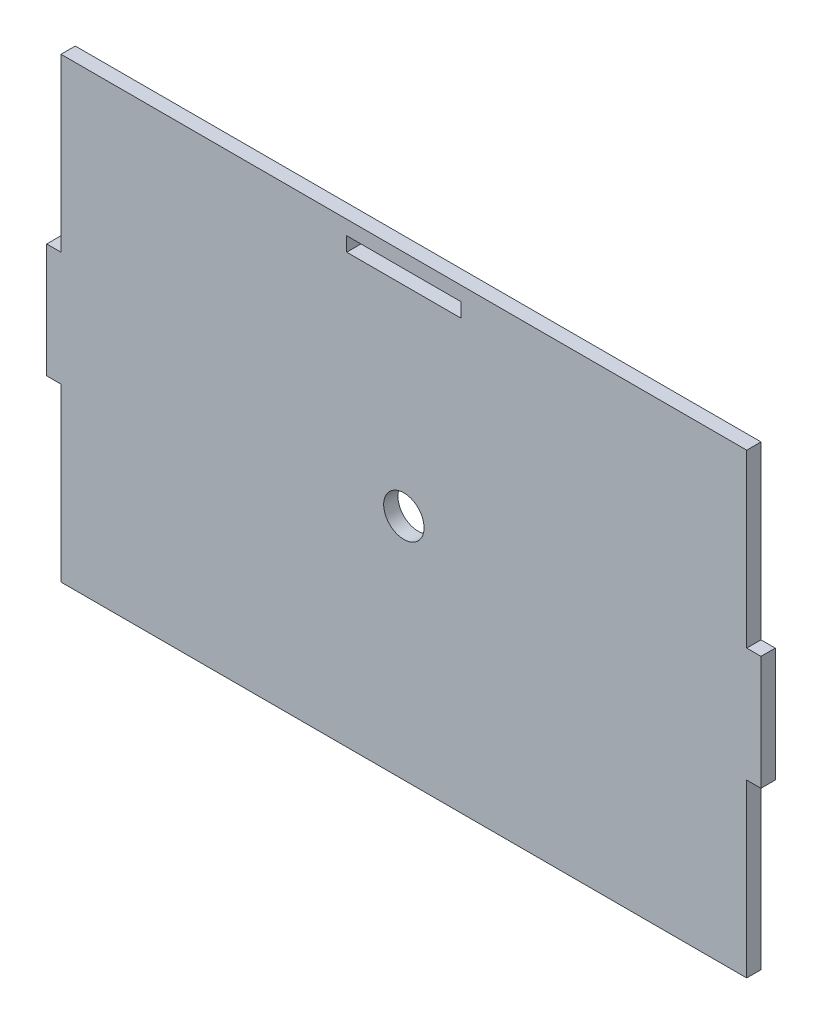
ISO-10303-21;
HEADER;
FILE_DESCRIPTION(('STEP AP214'),'2;1');
FILE_NAME('part.step','',(''),(''),'','','');
FILE_SCHEMA(('AUTOMOTIVE_DESIGN { 1 0 10303 214 1 1 1 1 }'));
ENDSEC;
DATA;
#1=APPLICATION_CONTEXT('core data for automotive mechanical design processes');
#2=APPLICATION_PROTOCOL_DEFINITION('international standard','automotive_design',2000,#1);
#3=PRODUCT_CONTEXT('',#1,'mechanical');
#4=PRODUCT('Part','Part','',(#3));
#5=PRODUCT_RELATED_PRODUCT_CATEGORY('part','',(#4));
#6=PRODUCT_DEFINITION_FORMATION('','',#4);
#7=PRODUCT_DEFINITION_CONTEXT('part definition',#1,'design');
#8=PRODUCT_DEFINITION('design','',#6,#7);
#9=PRODUCT_DEFINITION_SHAPE('','',#8);
#10=(LENGTH_UNIT() NAMED_UNIT(*) SI_UNIT(.MILLI.,.METRE.));
#11=(NAMED_UNIT(*) PLANE_ANGLE_UNIT() SI_UNIT($,.RADIAN.));
#12=(NAMED_UNIT(*) SI_UNIT($,.STERADIAN.) SOLID_ANGLE_UNIT());
#13=UNCERTAINTY_MEASURE_WITH_UNIT(LENGTH_MEASURE(1.E-05),#10,'distance_accuracy_value','');
#14=(GEOMETRIC_REPRESENTATION_CONTEXT(3) GLOBAL_UNCERTAINTY_ASSIGNED_CONTEXT((#13)) GLOBAL_UNIT_ASSIGNED_CONTEXT((#10,
#11,#12)) REPRESENTATION_CONTEXT('',''));
#15=CARTESIAN_POINT('',(0.,0.,0.));
#16=DIRECTION('',(0.,0.,1.));
#17=DIRECTION('',(1.,0.,0.));
#18=AXIS2_PLACEMENT_3D('',#15,#16,#17);
#19=CARTESIAN_POINT('',(-65.2029507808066,-1.40232473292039,3.175));
#20=DIRECTION('',(0.,0.,-1.));
#21=DIRECTION('',(-1.,0.,0.));
#22=AXIS2_PLACEMENT_3D('',#19,#20,#21);
#23=PLANE('',#22);
#24=DIRECTION('',(0.,-1.,0.));
#25=VECTOR('',#24,1.);
#26=CARTESIAN_POINT('',(-1.70295078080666,33.5226752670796,3.175));
#27=LINE('',#26,#25);
#28=CARTESIAN_POINT('',(-1.70295078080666,33.5226752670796,3.175));
#29=VERTEX_POINT('',#28);
#30=CARTESIAN_POINT('',(-1.70295078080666,30.3476752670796,3.175));
#31=VERTEX_POINT('',#30);
#32=EDGE_CURVE('E146',#29,#31,#27,.T.);
#33=ORIENTED_EDGE('',*,*,#32,.F.);
#34=DIRECTION('',(-1.,0.,0.));
#35=VECTOR('',#34,1.);
#36=CARTESIAN_POINT('',(-1.70295078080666,33.5226752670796,3.175));
#37=LINE('',#36,#35);
#38=CARTESIAN_POINT('',(23.6970492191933,33.5226752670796,3.175));
#39=VERTEX_POINT('',#38);
#40=EDGE_CURVE('E169',#39,#29,#37,.T.);
#41=ORIENTED_EDGE('',*,*,#40,.F.);
#42=DIRECTION('',(0.,1.,0.));
#43=VECTOR('',#42,1.);
#44=CARTESIAN_POINT('',(23.6970492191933,33.5226752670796,3.175));
#45=LINE('',#44,#43);
#46=CARTESIAN_POINT('',(23.6970492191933,30.3476752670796,3.175));
#47=VERTEX_POINT('',#46);
#48=EDGE_CURVE('E167',#47,#39,#45,.T.);
#49=ORIENTED_EDGE('',*,*,#48,.F.);
#50=DIRECTION('',(1.,0.,0.));
#51=VECTOR('',#50,1.);
#52=CARTESIAN_POINT('',(-1.70295078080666,30.3476752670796,3.175));
#53=LINE('',#52,#51);
#54=EDGE_CURVE('E154',#31,#47,#53,.T.);
#55=ORIENTED_EDGE('',*,*,#54,.F.);
#56=EDGE_LOOP('',(#33,#41,#49,#55));
#57=FACE_BOUND('',#56,.T.);
#58=DIRECTION('',(0.,-1.,0.));
#59=VECTOR('',#58,1.);
#60=CARTESIAN_POINT('',(-65.2029507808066,36.6976752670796,3.175));
#61=LINE('',#60,#59);
#62=CARTESIAN_POINT('',(-65.2029507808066,36.6976752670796,3.175));
#63=VERTEX_POINT('',#62);
#64=CARTESIAN_POINT('',(-65.2029507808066,-1.40232473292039,3.175));
#65=VERTEX_POINT('',#64);
#66=EDGE_CURVE('E185',#63,#65,#61,.T.);
#67=ORIENTED_EDGE('',*,*,#66,.T.);
#68=DIRECTION('',(-1.,0.,0.));
#69=VECTOR('',#68,1.);
#70=CARTESIAN_POINT('',(-65.2029507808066,-1.40232473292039,3.175));
#71=LINE('',#70,#69);
#72=CARTESIAN_POINT('',(-68.3779507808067,-1.40232473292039,3.175));
#73=VERTEX_POINT('',#72);
#74=EDGE_CURVE('E188',#65,#73,#71,.T.);
#75=ORIENTED_EDGE('',*,*,#74,.T.);
#76=DIRECTION('',(0.,-1.,0.));
#77=VECTOR('',#76,1.);
#78=CARTESIAN_POINT('',(-68.3779507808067,-1.40232473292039,3.175));
#79=LINE('',#78,#77);
#80=CARTESIAN_POINT('',(-68.3779507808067,-26.8023247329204,3.175));
#81=VERTEX_POINT('',#80);
#82=EDGE_CURVE('E191',#73,#81,#79,.T.);
#83=ORIENTED_EDGE('',*,*,#82,.T.);
#84=DIRECTION('',(1.,0.,0.));
#85=VECTOR('',#84,1.);
#86=CARTESIAN_POINT('',(-65.2029507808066,-26.8023247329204,3.175));
#87=LINE('',#86,#85);
#88=CARTESIAN_POINT('',(-65.2029507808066,-26.8023247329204,3.175));
#89=VERTEX_POINT('',#88);
#90=EDGE_CURVE('E193',#81,#89,#87,.T.);
#91=ORIENTED_EDGE('',*,*,#90,.T.);
#92=DIRECTION('',(0.,-1.,0.));
#93=VECTOR('',#92,1.);
#94=CARTESIAN_POINT('',(-65.2029507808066,-26.8023247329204,3.175));
#95=LINE('',#94,#93);
#96=CARTESIAN_POINT('',(-65.2029507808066,-64.9023247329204,3.175));
#97=VERTEX_POINT('',#96);
#98=EDGE_CURVE('E195',#89,#97,#95,.T.);
#99=ORIENTED_EDGE('',*,*,#98,.T.);
#100=DIRECTION('',(1.,0.,0.));
#101=VECTOR('',#100,1.);
#102=CARTESIAN_POINT('',(-65.2029507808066,-64.9023247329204,3.175));
#103=LINE('',#102,#101);
#104=CARTESIAN_POINT('',(87.1970492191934,-64.9023247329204,3.175));
#105=VERTEX_POINT('',#104);
#106=EDGE_CURVE('E197',#97,#105,#103,.T.);
#107=ORIENTED_EDGE('',*,*,#106,.T.);
#108=DIRECTION('',(0.,1.,0.));
#109=VECTOR('',#108,1.);
#110=CARTESIAN_POINT('',(87.1970492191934,-26.8023247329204,3.175));
#111=LINE('',#110,#109);
#112=CARTESIAN_POINT('',(87.1970492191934,-26.8023247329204,3.175));
#113=VERTEX_POINT('',#112);
#114=EDGE_CURVE('E199',#105,#113,#111,.T.);
#115=ORIENTED_EDGE('',*,*,#114,.T.);
#116=DIRECTION('',(1.,0.,0.));
#117=VECTOR('',#116,1.);
#118=CARTESIAN_POINT('',(87.1970492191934,-26.8023247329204,3.175));
#119=LINE('',#118,#117);
#120=CARTESIAN_POINT('',(90.3720492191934,-26.8023247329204,3.175));
#121=VERTEX_POINT('',#120);
#122=EDGE_CURVE('E201',#113,#121,#119,.T.);
#123=ORIENTED_EDGE('',*,*,#122,.T.);
#124=DIRECTION('',(0.,1.,0.));
#125=VECTOR('',#124,1.);
#126=CARTESIAN_POINT('',(90.3720492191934,-1.40232473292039,3.175));
#127=LINE('',#126,#125);
#128=CARTESIAN_POINT('',(90.3720492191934,-1.40232473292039,3.175));
#129=VERTEX_POINT('',#128);
#130=EDGE_CURVE('E203',#121,#129,#127,.T.);
#131=ORIENTED_EDGE('',*,*,#130,.T.);
#132=DIRECTION('',(-1.,0.,0.));
#133=VECTOR('',#132,1.);
#134=CARTESIAN_POINT('',(87.1970492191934,-1.40232473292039,3.175));
#135=LINE('',#134,#133);
#136=CARTESIAN_POINT('',(87.1970492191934,-1.40232473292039,3.175));
#137=VERTEX_POINT('',#136);
#138=EDGE_CURVE('E205',#129,#137,#135,.T.);
#139=ORIENTED_EDGE('',*,*,#138,.T.);
#140=DIRECTION('',(0.,1.,0.));
#141=VECTOR('',#140,1.);
#142=CARTESIAN_POINT('',(87.1970492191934,36.6976752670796,3.175));
#143=LINE('',#142,#141);
#144=CARTESIAN_POINT('',(87.1970492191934,36.6976752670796,3.175));
#145=VERTEX_POINT('',#144);
#146=EDGE_CURVE('E207',#137,#145,#143,.T.);
#147=ORIENTED_EDGE('',*,*,#146,.T.);
#148=DIRECTION('',(-1.,0.,0.));
#149=VECTOR('',#148,1.);
#150=CARTESIAN_POINT('',(36.3970492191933,36.6976752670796,3.175));
#151=LINE('',#150,#149);
#152=EDGE_CURVE('E209',#145,#63,#151,.T.);
#153=ORIENTED_EDGE('',*,*,#152,.T.);
#154=EDGE_LOOP('',(#67,#75,#83,#91,#99,#107,#115,#123,#131,#139,#147,#153));
#155=FACE_BOUND('',#154,.T.);
#156=CARTESIAN_POINT('',(10.9970492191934,-14.1023247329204,3.175));
#157=DIRECTION('',(0.,0.,1.));
#158=DIRECTION('',(1.,0.,0.));
#159=AXIS2_PLACEMENT_3D('',#156,#157,#158);
#160=CIRCLE('',#159,4.49012806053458);
#161=CARTESIAN_POINT('',(15.4871772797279,-14.1023247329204,3.175));
#162=VERTEX_POINT('',#161);
#163=EDGE_CURVE('E175',#162,#162,#160,.T.);
#164=ORIENTED_EDGE('',*,*,#163,.F.);
#165=EDGE_LOOP('',(#164));
#166=FACE_BOUND('',#165,.T.);
#167=ADVANCED_FACE('F33',(#57,#155,#166),#23,.F.);
#168=CARTESIAN_POINT('',(-65.2029507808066,-1.40232473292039,0.));
#169=DIRECTION('',(0.,0.,-1.));
#170=DIRECTION('',(-1.,0.,0.));
#171=AXIS2_PLACEMENT_3D('',#168,#169,#170);
#172=PLANE('',#171);
#173=DIRECTION('',(-1.,0.,0.));
#174=VECTOR('',#173,1.);
#175=CARTESIAN_POINT('',(-1.70295078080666,33.5226752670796,0.));
#176=LINE('',#175,#174);
#177=CARTESIAN_POINT('',(23.6970492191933,33.5226752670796,0.));
#178=VERTEX_POINT('',#177);
#179=CARTESIAN_POINT('',(-1.70295078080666,33.5226752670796,0.));
#180=VERTEX_POINT('',#179);
#181=EDGE_CURVE('E155',#178,#180,#176,.T.);
#182=ORIENTED_EDGE('',*,*,#181,.T.);
#183=DIRECTION('',(0.,-1.,0.));
#184=VECTOR('',#183,1.);
#185=CARTESIAN_POINT('',(-1.70295078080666,33.5226752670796,0.));
#186=LINE('',#185,#184);
#187=CARTESIAN_POINT('',(-1.70295078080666,30.3476752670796,0.));
#188=VERTEX_POINT('',#187);
#189=EDGE_CURVE('E56',#180,#188,#186,.T.);
#190=ORIENTED_EDGE('',*,*,#189,.T.);
#191=DIRECTION('',(1.,0.,0.));
#192=VECTOR('',#191,1.);
#193=CARTESIAN_POINT('',(-1.70295078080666,30.3476752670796,0.));
#194=LINE('',#193,#192);
#195=CARTESIAN_POINT('',(23.6970492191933,30.3476752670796,0.));
#196=VERTEX_POINT('',#195);
#197=EDGE_CURVE('E161',#188,#196,#194,.T.);
#198=ORIENTED_EDGE('',*,*,#197,.T.);
#199=DIRECTION('',(0.,1.,0.));
#200=VECTOR('',#199,1.);
#201=CARTESIAN_POINT('',(23.6970492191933,33.5226752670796,0.));
#202=LINE('',#201,#200);
#203=EDGE_CURVE('E177',#196,#178,#202,.T.);
#204=ORIENTED_EDGE('',*,*,#203,.T.);
#205=EDGE_LOOP('',(#182,#190,#198,#204));
#206=FACE_BOUND('',#205,.T.);
#207=DIRECTION('',(0.,-1.,0.));
#208=VECTOR('',#207,1.);
#209=CARTESIAN_POINT('',(-65.2029507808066,36.6976752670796,0.));
#210=LINE('',#209,#208);
#211=CARTESIAN_POINT('',(-65.2029507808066,36.6976752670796,0.));
#212=VERTEX_POINT('',#211);
#213=CARTESIAN_POINT('',(-65.2029507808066,-1.40232473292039,0.));
#214=VERTEX_POINT('',#213);
#215=EDGE_CURVE('E162',#212,#214,#210,.T.);
#216=ORIENTED_EDGE('',*,*,#215,.F.);
#217=DIRECTION('',(-1.,0.,0.));
#218=VECTOR('',#217,1.);
#219=CARTESIAN_POINT('',(-65.2029507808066,36.6976752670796,0.));
#220=LINE('',#219,#218);
#221=CARTESIAN_POINT('',(87.1970492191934,36.6976752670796,0.));
#222=VERTEX_POINT('',#221);
#223=EDGE_CURVE('E189',#222,#212,#220,.T.);
#224=ORIENTED_EDGE('',*,*,#223,.F.);
#225=DIRECTION('',(0.,1.,0.));
#226=VECTOR('',#225,1.);
#227=CARTESIAN_POINT('',(87.1970492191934,36.6976752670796,0.));
#228=LINE('',#227,#226);
#229=CARTESIAN_POINT('',(87.1970492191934,-1.40232473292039,0.));
#230=VERTEX_POINT('',#229);
#231=EDGE_CURVE('E232',#230,#222,#228,.T.);
#232=ORIENTED_EDGE('',*,*,#231,.F.);
#233=DIRECTION('',(-1.,0.,0.));
#234=VECTOR('',#233,1.);
#235=CARTESIAN_POINT('',(87.1970492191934,-1.40232473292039,0.));
#236=LINE('',#235,#234);
#237=CARTESIAN_POINT('',(90.3720492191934,-1.40232473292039,0.));
#238=VERTEX_POINT('',#237);
#239=EDGE_CURVE('E230',#238,#230,#236,.T.);
#240=ORIENTED_EDGE('',*,*,#239,.F.);
#241=DIRECTION('',(0.,1.,0.));
#242=VECTOR('',#241,1.);
#243=CARTESIAN_POINT('',(90.3720492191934,-1.40232473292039,0.));
#244=LINE('',#243,#242);
#245=CARTESIAN_POINT('',(90.3720492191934,-26.8023247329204,0.));
#246=VERTEX_POINT('',#245);
#247=EDGE_CURVE('E228',#246,#238,#244,.T.);
#248=ORIENTED_EDGE('',*,*,#247,.F.);
#249=DIRECTION('',(1.,0.,0.));
#250=VECTOR('',#249,1.);
#251=CARTESIAN_POINT('',(87.1970492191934,-26.8023247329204,0.));
#252=LINE('',#251,#250);
#253=CARTESIAN_POINT('',(87.1970492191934,-26.8023247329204,0.));
#254=VERTEX_POINT('',#253);
#255=EDGE_CURVE('E226',#254,#246,#252,.T.);
#256=ORIENTED_EDGE('',*,*,#255,.F.);
#257=DIRECTION('',(0.,1.,0.));
#258=VECTOR('',#257,1.);
#259=CARTESIAN_POINT('',(87.1970492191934,-26.8023247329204,0.));
#260=LINE('',#259,#258);
#261=CARTESIAN_POINT('',(87.1970492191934,-64.9023247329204,0.));
#262=VERTEX_POINT('',#261);
#263=EDGE_CURVE('E224',#262,#254,#260,.T.);
#264=ORIENTED_EDGE('',*,*,#263,.F.);
#265=DIRECTION('',(1.,0.,0.));
#266=VECTOR('',#265,1.);
#267=CARTESIAN_POINT('',(-65.2029507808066,-64.9023247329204,0.));
#268=LINE('',#267,#266);
#269=CARTESIAN_POINT('',(-65.2029507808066,-64.9023247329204,0.));
#270=VERTEX_POINT('',#269);
#271=EDGE_CURVE('E222',#270,#262,#268,.T.);
#272=ORIENTED_EDGE('',*,*,#271,.F.);
#273=DIRECTION('',(0.,-1.,0.));
#274=VECTOR('',#273,1.);
#275=CARTESIAN_POINT('',(-65.2029507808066,-26.8023247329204,0.));
#276=LINE('',#275,#274);
#277=CARTESIAN_POINT('',(-65.2029507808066,-26.8023247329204,0.));
#278=VERTEX_POINT('',#277);
#279=EDGE_CURVE('E220',#278,#270,#276,.T.);
#280=ORIENTED_EDGE('',*,*,#279,.F.);
#281=DIRECTION('',(1.,0.,0.));
#282=VECTOR('',#281,1.);
#283=CARTESIAN_POINT('',(-65.2029507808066,-26.8023247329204,0.));
#284=LINE('',#283,#282);
#285=CARTESIAN_POINT('',(-68.3779507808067,-26.8023247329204,0.));
#286=VERTEX_POINT('',#285);
#287=EDGE_CURVE('E218',#286,#278,#284,.T.);
#288=ORIENTED_EDGE('',*,*,#287,.F.);
#289=DIRECTION('',(0.,-1.,0.));
#290=VECTOR('',#289,1.);
#291=CARTESIAN_POINT('',(-68.3779507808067,-1.40232473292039,0.));
#292=LINE('',#291,#290);
#293=CARTESIAN_POINT('',(-68.3779507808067,-1.40232473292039,0.));
#294=VERTEX_POINT('',#293);
#295=EDGE_CURVE('E216',#294,#286,#292,.T.);
#296=ORIENTED_EDGE('',*,*,#295,.F.);
#297=DIRECTION('',(-1.,0.,0.));
#298=VECTOR('',#297,1.);
#299=CARTESIAN_POINT('',(-65.2029507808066,-1.40232473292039,0.));
#300=LINE('',#299,#298);
#301=EDGE_CURVE('E214',#214,#294,#300,.T.);
#302=ORIENTED_EDGE('',*,*,#301,.F.);
#303=EDGE_LOOP('',(#216,#224,#232,#240,#248,#256,#264,#272,#280,#288,#296,#302));
#304=FACE_BOUND('',#303,.T.);
#305=CARTESIAN_POINT('',(10.9970492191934,-14.1023247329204,0.));
#306=DIRECTION('',(0.,0.,1.));
#307=DIRECTION('',(1.,0.,0.));
#308=AXIS2_PLACEMENT_3D('',#305,#306,#307);
#309=CIRCLE('',#308,4.49012806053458);
#310=CARTESIAN_POINT('',(15.4871772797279,-14.1023247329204,0.));
#311=VERTEX_POINT('',#310);
#312=EDGE_CURVE('E492',#311,#311,#309,.T.);
#313=ORIENTED_EDGE('',*,*,#312,.T.);
#314=EDGE_LOOP('',(#313));
#315=FACE_BOUND('',#314,.T.);
#316=ADVANCED_FACE('F275',(#206,#304,#315),#172,.T.);
#317=CARTESIAN_POINT('',(-65.2029507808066,36.6976752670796,3.175));
#318=DIRECTION('',(1.,0.,0.));
#319=DIRECTION('',(0.,0.,-1.));
#320=AXIS2_PLACEMENT_3D('',#317,#318,#319);
#321=PLANE('',#320);
#322=ORIENTED_EDGE('',*,*,#215,.T.);
#323=DIRECTION('',(0.,0.,-1.));
#324=VECTOR('',#323,1.);
#325=CARTESIAN_POINT('',(-65.2029507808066,-1.40232473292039,3.175));
#326=LINE('',#325,#324);
#327=EDGE_CURVE('E11',#65,#214,#326,.T.);
#328=ORIENTED_EDGE('',*,*,#327,.F.);
#329=ORIENTED_EDGE('',*,*,#66,.F.);
#330=DIRECTION('',(0.,0.,-1.));
#331=VECTOR('',#330,1.);
#332=CARTESIAN_POINT('',(-65.2029507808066,36.6976752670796,3.175));
#333=LINE('',#332,#331);
#334=EDGE_CURVE('E211',#63,#212,#333,.T.);
#335=ORIENTED_EDGE('',*,*,#334,.T.);
#336=EDGE_LOOP('',(#322,#328,#329,#335));
#337=FACE_BOUND('',#336,.T.);
#338=ADVANCED_FACE('F35',(#337),#321,.F.);
#339=CARTESIAN_POINT('',(-65.2029507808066,-1.40232473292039,3.175));
#340=DIRECTION('',(0.,-1.,0.));
#341=DIRECTION('',(1.,0.,0.));
#342=AXIS2_PLACEMENT_3D('',#339,#340,#341);
#343=PLANE('',#342);
#344=ORIENTED_EDGE('',*,*,#301,.T.);
#345=DIRECTION('',(0.,0.,-1.));
#346=VECTOR('',#345,1.);
#347=CARTESIAN_POINT('',(-68.3779507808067,-1.40232473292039,3.175));
#348=LINE('',#347,#346);
#349=EDGE_CURVE('E41',#73,#294,#348,.T.);
#350=ORIENTED_EDGE('',*,*,#349,.F.);
#351=ORIENTED_EDGE('',*,*,#74,.F.);
#352=ORIENTED_EDGE('',*,*,#327,.T.);
#353=EDGE_LOOP('',(#344,#350,#351,#352));
#354=FACE_BOUND('',#353,.T.);
#355=ADVANCED_FACE('F292',(#354),#343,.F.);
#356=CARTESIAN_POINT('',(-68.3779507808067,-1.40232473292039,3.175));
#357=DIRECTION('',(1.,0.,0.));
#358=DIRECTION('',(0.,0.,-1.));
#359=AXIS2_PLACEMENT_3D('',#356,#357,#358);
#360=PLANE('',#359);
#361=ORIENTED_EDGE('',*,*,#295,.T.);
#362=DIRECTION('',(0.,0.,-1.));
#363=VECTOR('',#362,1.);
#364=CARTESIAN_POINT('',(-68.3779507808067,-26.8023247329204,3.175));
#365=LINE('',#364,#363);
#366=EDGE_CURVE('E262',#81,#286,#365,.T.);
#367=ORIENTED_EDGE('',*,*,#366,.F.);
#368=ORIENTED_EDGE('',*,*,#82,.F.);
#369=ORIENTED_EDGE('',*,*,#349,.T.);
#370=EDGE_LOOP('',(#361,#367,#368,#369));
#371=FACE_BOUND('',#370,.T.);
#372=ADVANCED_FACE('F269',(#371),#360,.F.);
#373=CARTESIAN_POINT('',(-65.2029507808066,-26.8023247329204,3.175));
#374=DIRECTION('',(0.,1.,0.));
#375=DIRECTION('',(-1.,0.,0.));
#376=AXIS2_PLACEMENT_3D('',#373,#374,#375);
#377=PLANE('',#376);
#378=ORIENTED_EDGE('',*,*,#287,.T.);
#379=DIRECTION('',(0.,0.,-1.));
#380=VECTOR('',#379,1.);
#381=CARTESIAN_POINT('',(-65.2029507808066,-26.8023247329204,3.175));
#382=LINE('',#381,#380);
#383=EDGE_CURVE('E259',#89,#278,#382,.T.);
#384=ORIENTED_EDGE('',*,*,#383,.F.);
#385=ORIENTED_EDGE('',*,*,#90,.F.);
#386=ORIENTED_EDGE('',*,*,#366,.T.);
#387=EDGE_LOOP('',(#378,#384,#385,#386));
#388=FACE_BOUND('',#387,.T.);
#389=ADVANCED_FACE('F281',(#388),#377,.F.);
#390=CARTESIAN_POINT('',(-65.2029507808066,-26.8023247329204,3.175));
#391=DIRECTION('',(1.,0.,0.));
#392=DIRECTION('',(0.,1.,0.));
#393=AXIS2_PLACEMENT_3D('',#390,#391,#392);
#394=PLANE('',#393);
#395=ORIENTED_EDGE('',*,*,#279,.T.);
#396=DIRECTION('',(0.,0.,-1.));
#397=VECTOR('',#396,1.);
#398=CARTESIAN_POINT('',(-65.2029507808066,-64.9023247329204,3.175));
#399=LINE('',#398,#397);
#400=EDGE_CURVE('E256',#97,#270,#399,.T.);
#401=ORIENTED_EDGE('',*,*,#400,.F.);
#402=ORIENTED_EDGE('',*,*,#98,.F.);
#403=ORIENTED_EDGE('',*,*,#383,.T.);
#404=EDGE_LOOP('',(#395,#401,#402,#403));
#405=FACE_BOUND('',#404,.T.);
#406=ADVANCED_FACE('F285',(#405),#394,.F.);
#407=CARTESIAN_POINT('',(-65.2029507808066,-64.9023247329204,3.175));
#408=DIRECTION('',(0.,1.,0.));
#409=DIRECTION('',(0.,0.,1.));
#410=AXIS2_PLACEMENT_3D('',#407,#408,#409);
#411=PLANE('',#410);
#412=ORIENTED_EDGE('',*,*,#271,.T.);
#413=DIRECTION('',(0.,0.,-1.));
#414=VECTOR('',#413,1.);
#415=CARTESIAN_POINT('',(87.1970492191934,-64.9023247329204,3.175));
#416=LINE('',#415,#414);
#417=EDGE_CURVE('E253',#105,#262,#416,.T.);
#418=ORIENTED_EDGE('',*,*,#417,.F.);
#419=ORIENTED_EDGE('',*,*,#106,.F.);
#420=ORIENTED_EDGE('',*,*,#400,.T.);
#421=EDGE_LOOP('',(#412,#418,#419,#420));
#422=FACE_BOUND('',#421,.T.);
#423=ADVANCED_FACE('F324',(#422),#411,.F.);
#424=CARTESIAN_POINT('',(87.1970492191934,-26.8023247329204,3.175));
#425=DIRECTION('',(-1.,0.,0.));
#426=DIRECTION('',(0.,0.,1.));
#427=AXIS2_PLACEMENT_3D('',#424,#425,#426);
#428=PLANE('',#427);
#429=ORIENTED_EDGE('',*,*,#263,.T.);
#430=DIRECTION('',(0.,0.,-1.));
#431=VECTOR('',#430,1.);
#432=CARTESIAN_POINT('',(87.1970492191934,-26.8023247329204,3.175));
#433=LINE('',#432,#431);
#434=EDGE_CURVE('E250',#113,#254,#433,.T.);
#435=ORIENTED_EDGE('',*,*,#434,.F.);
#436=ORIENTED_EDGE('',*,*,#114,.F.);
#437=ORIENTED_EDGE('',*,*,#417,.T.);
#438=EDGE_LOOP('',(#429,#435,#436,#437));
#439=FACE_BOUND('',#438,.T.);
#440=ADVANCED_FACE('F322',(#439),#428,.F.);
#441=CARTESIAN_POINT('',(87.1970492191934,-26.8023247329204,3.175));
#442=DIRECTION('',(0.,1.,0.));
#443=DIRECTION('',(0.,0.,1.));
#444=AXIS2_PLACEMENT_3D('',#441,#442,#443);
#445=PLANE('',#444);
#446=ORIENTED_EDGE('',*,*,#255,.T.);
#447=DIRECTION('',(0.,0.,-1.));
#448=VECTOR('',#447,1.);
#449=CARTESIAN_POINT('',(90.3720492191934,-26.8023247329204,3.175));
#450=LINE('',#449,#448);
#451=EDGE_CURVE('E247',#121,#246,#450,.T.);
#452=ORIENTED_EDGE('',*,*,#451,.F.);
#453=ORIENTED_EDGE('',*,*,#122,.F.);
#454=ORIENTED_EDGE('',*,*,#434,.T.);
#455=EDGE_LOOP('',(#446,#452,#453,#454));
#456=FACE_BOUND('',#455,.T.);
#457=ADVANCED_FACE('F318',(#456),#445,.F.);
#458=CARTESIAN_POINT('',(90.3720492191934,-1.40232473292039,3.175));
#459=DIRECTION('',(-1.,0.,0.));
#460=DIRECTION('',(0.,0.,1.));
#461=AXIS2_PLACEMENT_3D('',#458,#459,#460);
#462=PLANE('',#461);
#463=ORIENTED_EDGE('',*,*,#247,.T.);
#464=DIRECTION('',(0.,0.,-1.));
#465=VECTOR('',#464,1.);
#466=CARTESIAN_POINT('',(90.3720492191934,-1.40232473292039,3.175));
#467=LINE('',#466,#465);
#468=EDGE_CURVE('E244',#129,#238,#467,.T.);
#469=ORIENTED_EDGE('',*,*,#468,.F.);
#470=ORIENTED_EDGE('',*,*,#130,.F.);
#471=ORIENTED_EDGE('',*,*,#451,.T.);
#472=EDGE_LOOP('',(#463,#469,#470,#471));
#473=FACE_BOUND('',#472,.T.);
#474=ADVANCED_FACE('F314',(#473),#462,.F.);
#475=CARTESIAN_POINT('',(87.1970492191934,-1.40232473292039,3.175));
#476=DIRECTION('',(0.,-1.,0.));
#477=DIRECTION('',(0.,0.,-1.));
#478=AXIS2_PLACEMENT_3D('',#475,#476,#477);
#479=PLANE('',#478);
#480=ORIENTED_EDGE('',*,*,#239,.T.);
#481=DIRECTION('',(0.,0.,-1.));
#482=VECTOR('',#481,1.);
#483=CARTESIAN_POINT('',(87.1970492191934,-1.40232473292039,3.175));
#484=LINE('',#483,#482);
#485=EDGE_CURVE('E241',#137,#230,#484,.T.);
#486=ORIENTED_EDGE('',*,*,#485,.F.);
#487=ORIENTED_EDGE('',*,*,#138,.F.);
#488=ORIENTED_EDGE('',*,*,#468,.T.);
#489=EDGE_LOOP('',(#480,#486,#487,#488));
#490=FACE_BOUND('',#489,.T.);
#491=ADVANCED_FACE('F309',(#490),#479,.F.);
#492=CARTESIAN_POINT('',(87.1970492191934,36.6976752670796,3.175));
#493=DIRECTION('',(-1.,0.,0.));
#494=DIRECTION('',(0.,0.,1.));
#495=AXIS2_PLACEMENT_3D('',#492,#493,#494);
#496=PLANE('',#495);
#497=ORIENTED_EDGE('',*,*,#231,.T.);
#498=DIRECTION('',(0.,0.,-1.));
#499=VECTOR('',#498,1.);
#500=CARTESIAN_POINT('',(87.1970492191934,36.6976752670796,3.175));
#501=LINE('',#500,#499);
#502=EDGE_CURVE('E238',#145,#222,#501,.T.);
#503=ORIENTED_EDGE('',*,*,#502,.F.);
#504=ORIENTED_EDGE('',*,*,#146,.F.);
#505=ORIENTED_EDGE('',*,*,#485,.T.);
#506=EDGE_LOOP('',(#497,#503,#504,#505));
#507=FACE_BOUND('',#506,.T.);
#508=ADVANCED_FACE('F300',(#507),#496,.F.);
#509=CARTESIAN_POINT('',(-65.2029507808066,36.6976752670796,3.175));
#510=DIRECTION('',(0.,-1.,0.));
#511=DIRECTION('',(0.,0.,-1.));
#512=AXIS2_PLACEMENT_3D('',#509,#510,#511);
#513=PLANE('',#512);
#514=ORIENTED_EDGE('',*,*,#223,.T.);
#515=ORIENTED_EDGE('',*,*,#334,.F.);
#516=ORIENTED_EDGE('',*,*,#152,.F.);
#517=ORIENTED_EDGE('',*,*,#502,.T.);
#518=EDGE_LOOP('',(#514,#515,#516,#517));
#519=FACE_BOUND('',#518,.T.);
#520=ADVANCED_FACE('F304',(#519),#513,.F.);
#521=CARTESIAN_POINT('',(-1.70295078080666,33.5226752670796,3.175));
#522=DIRECTION('',(1.,0.,0.));
#523=DIRECTION('',(0.,1.,0.));
#524=AXIS2_PLACEMENT_3D('',#521,#522,#523);
#525=PLANE('',#524);
#526=ORIENTED_EDGE('',*,*,#189,.F.);
#527=DIRECTION('',(0.,0.,-1.));
#528=VECTOR('',#527,1.);
#529=CARTESIAN_POINT('',(-1.70295078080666,33.5226752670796,3.175));
#530=LINE('',#529,#528);
#531=EDGE_CURVE('E150',#29,#180,#530,.T.);
#532=ORIENTED_EDGE('',*,*,#531,.F.);
#533=ORIENTED_EDGE('',*,*,#32,.T.);
#534=DIRECTION('',(0.,0.,-1.));
#535=VECTOR('',#534,1.);
#536=CARTESIAN_POINT('',(-1.70295078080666,30.3476752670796,3.175));
#537=LINE('',#536,#535);
#538=EDGE_CURVE('E149',#31,#188,#537,.T.);
#539=ORIENTED_EDGE('',*,*,#538,.T.);
#540=EDGE_LOOP('',(#526,#532,#533,#539));
#541=FACE_BOUND('',#540,.T.);
#542=ADVANCED_FACE('F148',(#541),#525,.T.);
#543=CARTESIAN_POINT('',(-1.70295078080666,30.3476752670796,3.175));
#544=DIRECTION('',(0.,1.,0.));
#545=DIRECTION('',(0.,0.,1.));
#546=AXIS2_PLACEMENT_3D('',#543,#544,#545);
#547=PLANE('',#546);
#548=ORIENTED_EDGE('',*,*,#197,.F.);
#549=ORIENTED_EDGE('',*,*,#538,.F.);
#550=ORIENTED_EDGE('',*,*,#54,.T.);
#551=DIRECTION('',(0.,0.,-1.));
#552=VECTOR('',#551,1.);
#553=CARTESIAN_POINT('',(23.6970492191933,30.3476752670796,3.175));
#554=LINE('',#553,#552);
#555=EDGE_CURVE('E163',#47,#196,#554,.T.);
#556=ORIENTED_EDGE('',*,*,#555,.T.);
#557=EDGE_LOOP('',(#548,#549,#550,#556));
#558=FACE_BOUND('',#557,.T.);
#559=ADVANCED_FACE('F158',(#558),#547,.T.);
#560=CARTESIAN_POINT('',(23.6970492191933,33.5226752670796,3.175));
#561=DIRECTION('',(-1.,0.,0.));
#562=DIRECTION('',(0.,-1.,0.));
#563=AXIS2_PLACEMENT_3D('',#560,#561,#562);
#564=PLANE('',#563);
#565=ORIENTED_EDGE('',*,*,#203,.F.);
#566=ORIENTED_EDGE('',*,*,#555,.F.);
#567=ORIENTED_EDGE('',*,*,#48,.T.);
#568=DIRECTION('',(0.,0.,-1.));
#569=VECTOR('',#568,1.);
#570=CARTESIAN_POINT('',(23.6970492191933,33.5226752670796,3.175));
#571=LINE('',#570,#569);
#572=EDGE_CURVE('E48',#39,#178,#571,.T.);
#573=ORIENTED_EDGE('',*,*,#572,.T.);
#574=EDGE_LOOP('',(#565,#566,#567,#573));
#575=FACE_BOUND('',#574,.T.);
#576=ADVANCED_FACE('F383',(#575),#564,.T.);
#577=CARTESIAN_POINT('',(-1.70295078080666,33.5226752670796,3.175));
#578=DIRECTION('',(0.,-1.,0.));
#579=DIRECTION('',(0.,0.,-1.));
#580=AXIS2_PLACEMENT_3D('',#577,#578,#579);
#581=PLANE('',#580);
#582=ORIENTED_EDGE('',*,*,#181,.F.);
#583=ORIENTED_EDGE('',*,*,#572,.F.);
#584=ORIENTED_EDGE('',*,*,#40,.T.);
#585=ORIENTED_EDGE('',*,*,#531,.T.);
#586=EDGE_LOOP('',(#582,#583,#584,#585));
#587=FACE_BOUND('',#586,.T.);
#588=ADVANCED_FACE('F389',(#587),#581,.T.);
#589=CARTESIAN_POINT('',(10.9970492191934,-14.1023247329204,3.175));
#590=DIRECTION('',(0.,0.,-1.));
#591=DIRECTION('',(-1.,0.,0.));
#592=AXIS2_PLACEMENT_3D('',#589,#590,#591);
#593=CYLINDRICAL_SURFACE('',#592,4.49012806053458);
#594=ORIENTED_EDGE('',*,*,#163,.T.);
#595=EDGE_LOOP('',(#594));
#596=FACE_BOUND('',#595,.T.);
#597=ORIENTED_EDGE('',*,*,#312,.F.);
#598=EDGE_LOOP('',(#597));
#599=FACE_BOUND('',#598,.T.);
#600=ADVANCED_FACE('F397',(#596,#599),#593,.F.);
#601=CLOSED_SHELL('',(#167,#316,#338,#355,#372,#389,#406,#423,#440,#457,#474,#491,#508,#520,
#542,#559,#576,#588,#600));
#602=MANIFOLD_SOLID_BREP('B2',#601);
#603=ADVANCED_BREP_SHAPE_REPRESENTATION('',(#18,#602),#14);
#604=SHAPE_DEFINITION_REPRESENTATION(#9,#603);
ENDSEC;
END-ISO-10303-21;
